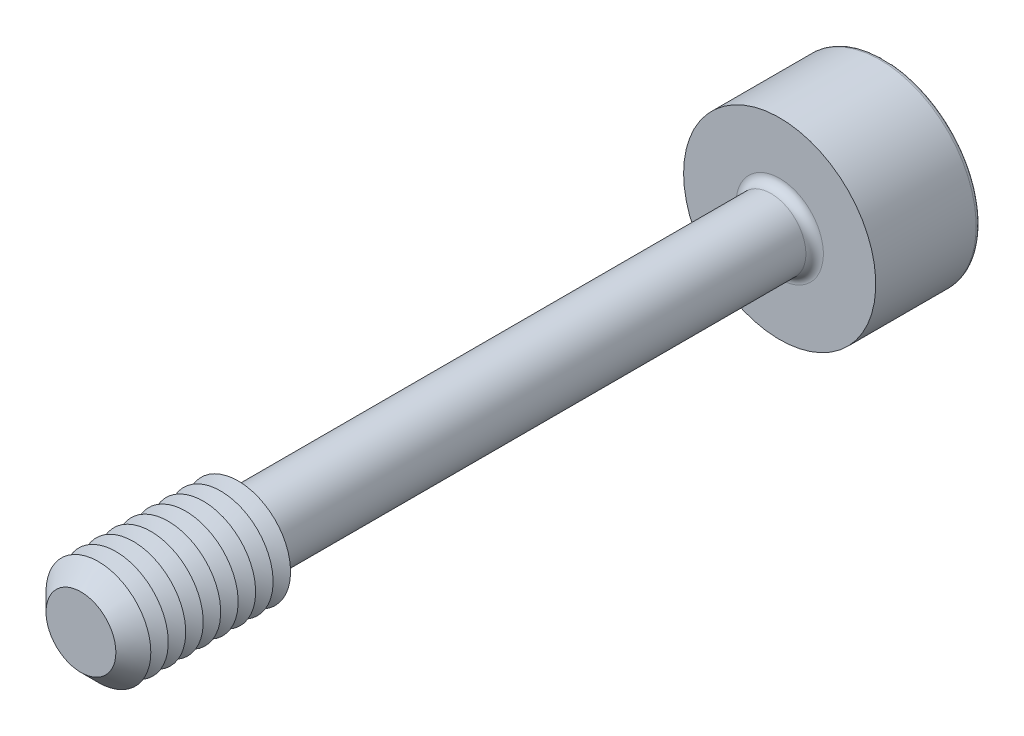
from build123d import *

# Parameters (mm, degrees)
SKETCH1_R       = 1
EXTRUDE1_DEPTH  = 10
CHAMFER1_SIZE   = 0.5
SKETCH3_R       = 2.75
EXTRUDE2_DEPTH  = 3
EXTRUDE3_DEPTH  = 2.5
FILLET1_R       = 0.25
FILLET2_R       = 0.125
LPATTERN1_COUNT = 8
LPATTERN1_PITCH = 0.5


with BuildPart() as part:
    # Sketch1 → Extrude1 (new, symmetric)
    with BuildSketch(Plane.XY):
        Circle(SKETCH1_R)
    extrude(amount=EXTRUDE1_DEPTH, both=True)

    # Sketch2 → Revolve1 (revolve)
    with BuildSketch(Plane(origin=(0, 0, 0), x_dir=(0, 0, -1), z_dir=(1, 0, 0))):
        Polygon((-10, 0), (-10, 1.5), (-5.5, 1.5), (-5.211324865, 1), (-5.211324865, 0), align=None)
    revolve(axis=Axis((0, 0, 5.211324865), (0, 0, 1)))

    # Chamfer1
    chamfer1_edges = [part.edges().sort_by_distance(p)[0] for p in [
        (0, -1.5, 10),
    ]]
    chamfer(chamfer1_edges, length=CHAMFER1_SIZE)

    # Sketch3 → Extrude2 (add)
    with BuildSketch(Plane(origin=(0, 0, -10), x_dir=(-1, 0, 0), z_dir=(0, 0, -1))):
        Circle(SKETCH3_R)
    extrude(amount=EXTRUDE2_DEPTH)

    # Sketch4 → Extrude3 (cut)
    with BuildSketch(Plane(origin=(-13.7, 0, -13), x_dir=(1, 0, 0), z_dir=(0, 0, 1))):
        Polygon((12.978312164, -1.25), (14.421687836, -1.25), (15.143375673, 0), (14.421687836, 1.25), (12.978312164, 1.25), (12.256624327, 0), align=None)
    extrude(amount=EXTRUDE3_DEPTH, mode=Mode.SUBTRACT)

    # Fillet1
    fillet1_edges = [part.edges().sort_by_distance(p)[0] for p in [
        (-1, 0, -10),
    ]]
    fillet(fillet1_edges, radius=FILLET1_R)

    # Fillet2
    fillet2_edges = [part.edges().sort_by_distance(p)[0] for p in [
        (2.75, 0, -13),
    ]]
    fillet(fillet2_edges, radius=FILLET2_R)

    # Sketch5 → Cut-Revolve1 (revolve, cut)
    with BuildSketch(Plane(origin=(0, 0, 0), x_dir=(0, 0, -1), z_dir=(1, 0, 0)), mode=Mode.PRIVATE) as cut_revolve1_sk:
        Polygon((10.5, 0), (10.5, -1.25), (9.778312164, 0), align=None)
    revolve(cut_revolve1_sk.sketch.rotate(Axis((0, 0, -9.778312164), (0, 0, -1)), 90), axis=Axis((0, 0, -9.778312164), (0, 0, -1)), mode=Mode.SUBTRACT)

    # Sketch7 → Cut-Revolve2 (revolve, cut)
    with BuildSketch(Plane(origin=(0, 0, 0), x_dir=(0, 0, -1), z_dir=(1, 0, 0)), mode=Mode.PRIVATE) as cut_revolve2_sk:
        Polygon((-5.5, 1.5), (-5.75, 1.066987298), (-6, 1.5), align=None)
    cut_revolve2 = revolve(cut_revolve2_sk.sketch.rotate(Axis((0, 0, -1.332048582), (0, 0, 1)), 90), axis=Axis((0, 0, -1.332048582), (0, 0, 1)), mode=Mode.SUBTRACT)

    # LPattern1: Cut-Revolve2 ×8
    with Locations(*[(0, 0, i * LPATTERN1_PITCH) for i in range(1, LPATTERN1_COUNT)]):
        add(cut_revolve2, mode=Mode.SUBTRACT)


solid = part.part
